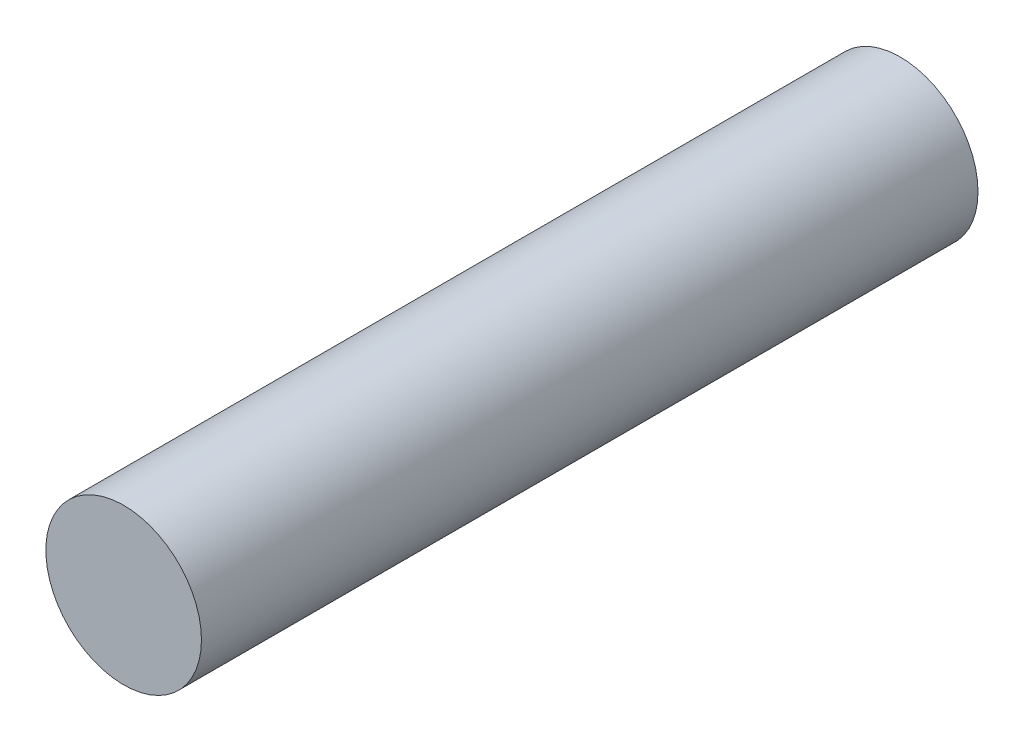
ISO-10303-21;
HEADER;
FILE_DESCRIPTION(('STEP AP214'),'2;1');
FILE_NAME('part.step','',(''),(''),'','','');
FILE_SCHEMA(('AUTOMOTIVE_DESIGN { 1 0 10303 214 1 1 1 1 }'));
ENDSEC;
DATA;
#1=APPLICATION_CONTEXT('core data for automotive mechanical design processes');
#2=APPLICATION_PROTOCOL_DEFINITION('international standard','automotive_design',2000,#1);
#3=PRODUCT_CONTEXT('',#1,'mechanical');
#4=PRODUCT('Part','Part','',(#3));
#5=PRODUCT_RELATED_PRODUCT_CATEGORY('part','',(#4));
#6=PRODUCT_DEFINITION_FORMATION('','',#4);
#7=PRODUCT_DEFINITION_CONTEXT('part definition',#1,'design');
#8=PRODUCT_DEFINITION('design','',#6,#7);
#9=PRODUCT_DEFINITION_SHAPE('','',#8);
#10=(LENGTH_UNIT() NAMED_UNIT(*) SI_UNIT(.MILLI.,.METRE.));
#11=(NAMED_UNIT(*) PLANE_ANGLE_UNIT() SI_UNIT($,.RADIAN.));
#12=(NAMED_UNIT(*) SI_UNIT($,.STERADIAN.) SOLID_ANGLE_UNIT());
#13=UNCERTAINTY_MEASURE_WITH_UNIT(LENGTH_MEASURE(1.E-05),#10,'distance_accuracy_value','');
#14=(GEOMETRIC_REPRESENTATION_CONTEXT(3) GLOBAL_UNCERTAINTY_ASSIGNED_CONTEXT((#13)) GLOBAL_UNIT_ASSIGNED_CONTEXT((#10,
#11,#12)) REPRESENTATION_CONTEXT('',''));
#15=CARTESIAN_POINT('',(0.,0.,0.));
#16=DIRECTION('',(0.,0.,1.));
#17=DIRECTION('',(1.,0.,0.));
#18=AXIS2_PLACEMENT_3D('',#15,#16,#17);
#19=CARTESIAN_POINT('',(0.,0.,-149.717743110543));
#20=DIRECTION('',(0.,0.,1.));
#21=DIRECTION('',(1.,0.,0.));
#22=AXIS2_PLACEMENT_3D('',#19,#20,#21);
#23=CYLINDRICAL_SURFACE('',#22,15.);
#24=CARTESIAN_POINT('',(0.,0.,-149.717743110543));
#25=DIRECTION('',(0.,0.,1.));
#26=DIRECTION('',(1.,0.,0.));
#27=AXIS2_PLACEMENT_3D('',#24,#25,#26);
#28=CIRCLE('',#27,15.);
#29=CARTESIAN_POINT('',(15.,0.,-149.717743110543));
#30=VERTEX_POINT('',#29);
#31=EDGE_CURVE('E10',#30,#30,#28,.T.);
#32=ORIENTED_EDGE('',*,*,#31,.T.);
#33=EDGE_LOOP('',(#32));
#34=FACE_BOUND('',#33,.T.);
#35=CARTESIAN_POINT('',(0.,0.,0.));
#36=DIRECTION('',(0.,0.,1.));
#37=DIRECTION('',(1.,0.,0.));
#38=AXIS2_PLACEMENT_3D('',#35,#36,#37);
#39=CIRCLE('',#38,15.);
#40=CARTESIAN_POINT('',(15.,0.,0.));
#41=VERTEX_POINT('',#40);
#42=EDGE_CURVE('E32',#41,#41,#39,.T.);
#43=ORIENTED_EDGE('',*,*,#42,.F.);
#44=EDGE_LOOP('',(#43));
#45=FACE_BOUND('',#44,.T.);
#46=ADVANCED_FACE('F26',(#34,#45),#23,.T.);
#47=CARTESIAN_POINT('',(0.,0.,-149.717743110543));
#48=DIRECTION('',(0.,0.,1.));
#49=DIRECTION('',(1.,0.,0.));
#50=AXIS2_PLACEMENT_3D('',#47,#48,#49);
#51=PLANE('',#50);
#52=ORIENTED_EDGE('',*,*,#31,.F.);
#53=EDGE_LOOP('',(#52));
#54=FACE_BOUND('',#53,.T.);
#55=ADVANCED_FACE('F41',(#54),#51,.F.);
#56=CARTESIAN_POINT('',(0.,0.,0.));
#57=DIRECTION('',(0.,0.,1.));
#58=DIRECTION('',(1.,0.,0.));
#59=AXIS2_PLACEMENT_3D('',#56,#57,#58);
#60=PLANE('',#59);
#61=ORIENTED_EDGE('',*,*,#42,.T.);
#62=EDGE_LOOP('',(#61));
#63=FACE_BOUND('',#62,.T.);
#64=ADVANCED_FACE('F38',(#63),#60,.T.);
#65=CLOSED_SHELL('',(#46,#55,#64));
#66=MANIFOLD_SOLID_BREP('B2',#65);
#67=ADVANCED_BREP_SHAPE_REPRESENTATION('',(#18,#66),#14);
#68=SHAPE_DEFINITION_REPRESENTATION(#9,#67);
ENDSEC;
END-ISO-10303-21;
